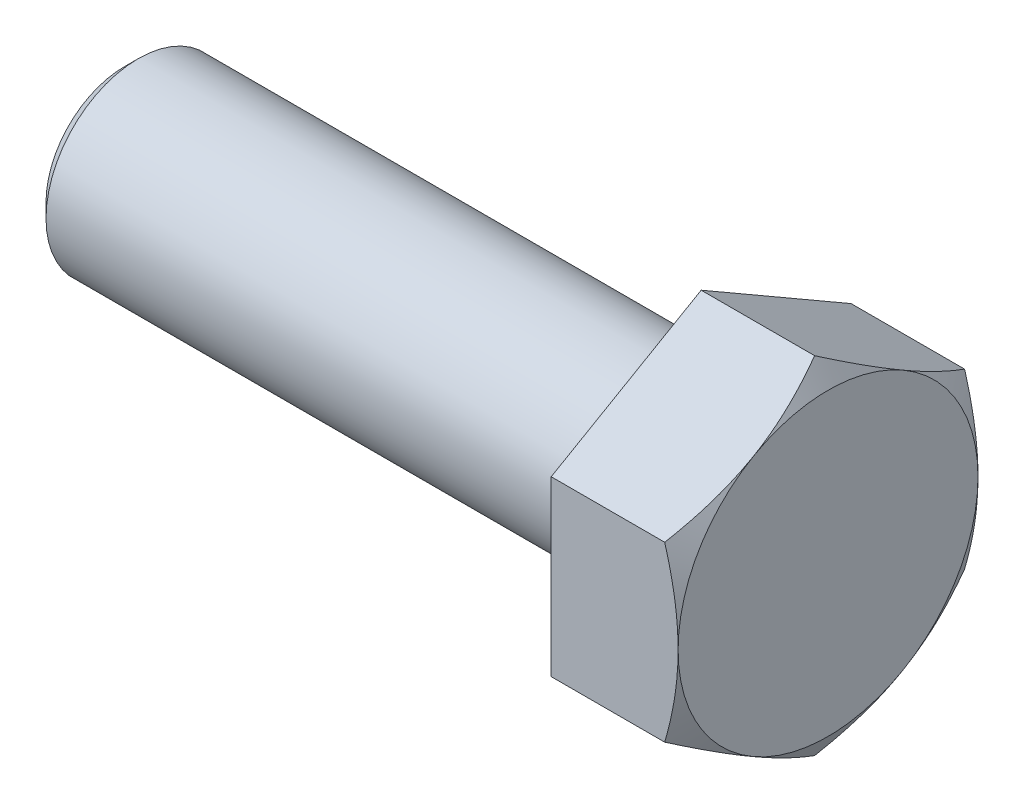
ISO-10303-21;
HEADER;
FILE_DESCRIPTION(('STEP AP214'),'2;1');
FILE_NAME('part.step','',(''),(''),'','','');
FILE_SCHEMA(('AUTOMOTIVE_DESIGN { 1 0 10303 214 1 1 1 1 }'));
ENDSEC;
DATA;
#1=APPLICATION_CONTEXT('core data for automotive mechanical design processes');
#2=APPLICATION_PROTOCOL_DEFINITION('international standard','automotive_design',2000,#1);
#3=PRODUCT_CONTEXT('',#1,'mechanical');
#4=PRODUCT('Part','Part','',(#3));
#5=PRODUCT_RELATED_PRODUCT_CATEGORY('part','',(#4));
#6=PRODUCT_DEFINITION_FORMATION('','',#4);
#7=PRODUCT_DEFINITION_CONTEXT('part definition',#1,'design');
#8=PRODUCT_DEFINITION('design','',#6,#7);
#9=PRODUCT_DEFINITION_SHAPE('','',#8);
#10=(LENGTH_UNIT() NAMED_UNIT(*) SI_UNIT(.MILLI.,.METRE.));
#11=(NAMED_UNIT(*) PLANE_ANGLE_UNIT() SI_UNIT($,.RADIAN.));
#12=(NAMED_UNIT(*) SI_UNIT($,.STERADIAN.) SOLID_ANGLE_UNIT());
#13=UNCERTAINTY_MEASURE_WITH_UNIT(LENGTH_MEASURE(1.E-05),#10,'distance_accuracy_value','');
#14=(GEOMETRIC_REPRESENTATION_CONTEXT(3) GLOBAL_UNCERTAINTY_ASSIGNED_CONTEXT((#13)) GLOBAL_UNIT_ASSIGNED_CONTEXT((#10,
#11,#12)) REPRESENTATION_CONTEXT('',''));
#15=CARTESIAN_POINT('',(0.,0.,0.));
#16=DIRECTION('',(0.,0.,1.));
#17=DIRECTION('',(1.,0.,0.));
#18=AXIS2_PLACEMENT_3D('',#15,#16,#17);
#19=CARTESIAN_POINT('',(5.5,3.75277674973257,6.5));
#20=DIRECTION('',(0.,0.866025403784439,0.5));
#21=DIRECTION('',(0.,-0.5,0.866025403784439));
#22=AXIS2_PLACEMENT_3D('',#19,#20,#21);
#23=PLANE('',#22);
#24=DIRECTION('',(-1.,0.,0.));
#25=VECTOR('',#24,1.);
#26=CARTESIAN_POINT('',(5.5,3.75277674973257,6.5));
#27=LINE('',#26,#25);
#28=CARTESIAN_POINT('',(4.91944341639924,3.75277674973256,6.5));
#29=VERTEX_POINT('',#28);
#30=CARTESIAN_POINT('',(0.,3.75277674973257,6.5));
#31=VERTEX_POINT('',#30);
#32=EDGE_CURVE('E140',#29,#31,#27,.T.);
#33=ORIENTED_EDGE('',*,*,#32,.F.);
#34=CARTESIAN_POINT('',(4.91937674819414,3.75266127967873,6.5002));
#35=CARTESIAN_POINT('',(4.96699557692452,3.8351516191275,6.35732254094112));
#36=CARTESIAN_POINT('',(5.0124532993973,3.91794952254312,6.21391236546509));
#37=CARTESIAN_POINT('',(5.09845131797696,4.08421773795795,5.9259273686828));
#38=CARTESIAN_POINT('',(5.13898949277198,4.16768832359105,5.78135207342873));
#39=CARTESIAN_POINT('',(5.25242899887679,4.41943655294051,5.34531134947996));
#40=CARTESIAN_POINT('',(5.31695219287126,4.58870793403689,5.05212471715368));
#41=CARTESIAN_POINT('',(5.39261341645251,4.84201947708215,4.61337625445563));
#42=CARTESIAN_POINT('',(5.41416714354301,4.92530276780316,4.46912536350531));
#43=CARTESIAN_POINT('',(5.45030968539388,5.09224566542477,4.17997178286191));
#44=CARTESIAN_POINT('',(5.46489911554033,5.17590523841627,4.03506915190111));
#45=CARTESIAN_POINT('',(5.48674124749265,5.34336968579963,3.74501222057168));
#46=CARTESIAN_POINT('',(5.49400227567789,5.427174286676,3.59985839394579));
#47=CARTESIAN_POINT('',(5.50103969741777,5.59485627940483,3.30942466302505));
#48=CARTESIAN_POINT('',(5.5008163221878,5.6787336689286,3.16414476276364));
#49=CARTESIAN_POINT('',(5.48991654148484,5.90853103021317,2.76612405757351));
#50=CARTESIAN_POINT('',(5.47161818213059,6.05437578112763,2.51351353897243));
#51=CARTESIAN_POINT('',(5.41359365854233,6.34509659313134,2.00997032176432));
#52=CARTESIAN_POINT('',(5.37384766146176,6.48997163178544,1.75903939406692));
#53=CARTESIAN_POINT('',(5.27449409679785,6.78127752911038,1.25448277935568));
#54=CARTESIAN_POINT('',(5.21446557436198,6.92767163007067,1.00092075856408));
#55=CARTESIAN_POINT('',(5.07822500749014,7.21827667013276,0.497578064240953));
#56=CARTESIAN_POINT('',(5.00204496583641,7.36249133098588,0.247790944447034));
#57=CARTESIAN_POINT('',(4.91937674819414,7.50566896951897,-0.000200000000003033));
#58=B_SPLINE_CURVE_WITH_KNOTS('',3,(#34,#35,#36,#37,#38,#39,#40,#41,#42,#43,#44,#45,#46,#47,#48,
#49,#50,#51,#52,#53,#54,#55,#56,#57),.UNSPECIFIED.,.F.,.F.,(4,2,2,2,2,2,2,2,2,2,2,4),(0.,
0.515105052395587,1.03043143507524,2.06322554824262,2.56697389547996,3.07067772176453,
3.57380860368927,4.07692394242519,4.9527935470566,5.82947446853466,6.72559912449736,
7.61996451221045),.UNSPECIFIED.);
#59=CARTESIAN_POINT('',(5.5,5.62916512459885,3.25));
#60=VERTEX_POINT('',#59);
#61=EDGE_CURVE('E120',#29,#60,#58,.T.);
#62=ORIENTED_EDGE('',*,*,#61,.T.);
#63=CARTESIAN_POINT('',(4.91944341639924,7.50555349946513,0.));
#64=VERTEX_POINT('',#63);
#65=EDGE_CURVE('E108',#60,#64,#58,.T.);
#66=ORIENTED_EDGE('',*,*,#65,.T.);
#67=DIRECTION('',(-1.,0.,0.));
#68=VECTOR('',#67,1.);
#69=CARTESIAN_POINT('',(5.5,7.50555349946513,0.));
#70=LINE('',#69,#68);
#71=CARTESIAN_POINT('',(0.,7.50555349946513,0.));
#72=VERTEX_POINT('',#71);
#73=EDGE_CURVE('E118',#64,#72,#70,.T.);
#74=ORIENTED_EDGE('',*,*,#73,.T.);
#75=DIRECTION('',(0.,0.5,-0.866025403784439));
#76=VECTOR('',#75,1.);
#77=CARTESIAN_POINT('',(0.,3.75277674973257,6.5));
#78=LINE('',#77,#76);
#79=EDGE_CURVE('E238',#31,#72,#78,.T.);
#80=ORIENTED_EDGE('',*,*,#79,.F.);
#81=EDGE_LOOP('',(#33,#62,#66,#74,#80));
#82=FACE_BOUND('',#81,.T.);
#83=ADVANCED_FACE('F34',(#82),#23,.T.);
#84=CARTESIAN_POINT('',(5.5,-3.75277674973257,6.5));
#85=DIRECTION('',(0.,0.,1.));
#86=DIRECTION('',(1.,0.,0.));
#87=AXIS2_PLACEMENT_3D('',#84,#85,#86);
#88=PLANE('',#87);
#89=DIRECTION('',(-1.,0.,0.));
#90=VECTOR('',#89,1.);
#91=CARTESIAN_POINT('',(5.5,-3.75277674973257,6.5));
#92=LINE('',#91,#90);
#93=CARTESIAN_POINT('',(4.91944341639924,-3.75277674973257,6.5));
#94=VERTEX_POINT('',#93);
#95=CARTESIAN_POINT('',(0.,-3.75277674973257,6.5));
#96=VERTEX_POINT('',#95);
#97=EDGE_CURVE('E168',#94,#96,#92,.T.);
#98=ORIENTED_EDGE('',*,*,#97,.F.);
#99=CARTESIAN_POINT('',(2.38957641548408,-9.95291698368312,6.5));
#100=CARTESIAN_POINT('',(2.52749106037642,-9.66753022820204,6.5));
#101=CARTESIAN_POINT('',(2.66403471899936,-9.38146872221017,6.5));
#102=CARTESIAN_POINT('',(2.9335966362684,-8.80763137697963,6.5));
#103=CARTESIAN_POINT('',(3.0666142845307,-8.51985525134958,6.5));
#104=CARTESIAN_POINT('',(3.3290414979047,-7.94066929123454,6.5));
#105=CARTESIAN_POINT('',(3.45842605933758,-7.64924808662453,6.5));
#106=CARTESIAN_POINT('',(3.71163779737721,-7.06401043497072,6.5));
#107=CARTESIAN_POINT('',(3.8354652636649,-6.77019411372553,6.5));
#108=CARTESIAN_POINT('',(4.07755519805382,-6.17605150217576,6.5));
#109=CARTESIAN_POINT('',(4.19573068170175,-5.87568957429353,6.5));
#110=CARTESIAN_POINT('',(4.42282610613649,-5.27142269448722,6.5));
#111=CARTESIAN_POINT('',(4.53174501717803,-4.96751735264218,6.5));
#112=CARTESIAN_POINT('',(4.73740097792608,-4.3563054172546,6.5));
#113=CARTESIAN_POINT('',(4.83416392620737,-4.04900762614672,6.5));
#114=CARTESIAN_POINT('',(5.01236428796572,-3.43004022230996,6.5));
#115=CARTESIAN_POINT('',(5.09380654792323,-3.11837202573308,6.5));
#116=CARTESIAN_POINT('',(5.23741591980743,-2.49046594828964,6.5));
#117=CARTESIAN_POINT('',(5.29957789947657,-2.17422687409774,6.5));
#118=CARTESIAN_POINT('',(5.40042577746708,-1.5378916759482,6.5));
#119=CARTESIAN_POINT('',(5.43911165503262,-1.21779554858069,6.5));
#120=CARTESIAN_POINT('',(5.47705343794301,-0.737141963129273,6.5));
#121=CARTESIAN_POINT('',(5.48635478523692,-0.577336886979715,6.5));
#122=CARTESIAN_POINT('',(5.49818591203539,-0.257468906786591,6.5));
#123=CARTESIAN_POINT('',(5.50071577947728,-0.0974060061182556,6.5));
#124=CARTESIAN_POINT('',(5.49893598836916,0.222635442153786,6.5));
#125=CARTESIAN_POINT('',(5.49462824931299,0.382614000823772,6.5));
#126=CARTESIAN_POINT('',(5.47928241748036,0.702250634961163,6.5));
#127=CARTESIAN_POINT('',(5.46824398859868,0.861908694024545,6.5));
#128=CARTESIAN_POINT('',(5.43356313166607,1.24887053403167,6.5));
#129=CARTESIAN_POINT('',(5.40654812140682,1.47587694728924,6.5));
#130=CARTESIAN_POINT('',(5.34041011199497,1.928150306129,6.5));
#131=CARTESIAN_POINT('',(5.3012838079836,2.15341675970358,6.5));
#132=CARTESIAN_POINT('',(5.2123108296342,2.60202427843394,6.5));
#133=CARTESIAN_POINT('',(5.16245401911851,2.8253633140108,6.5));
#134=CARTESIAN_POINT('',(5.05354123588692,3.2697435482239,6.5));
#135=CARTESIAN_POINT('',(4.99448612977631,3.490784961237,6.5));
#136=CARTESIAN_POINT('',(4.86704588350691,3.93601414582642,6.5));
#137=CARTESIAN_POINT('',(4.79846752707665,4.16014622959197,6.5));
#138=CARTESIAN_POINT('',(4.65453487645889,4.60604131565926,6.5));
#139=CARTESIAN_POINT('',(4.57918525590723,4.82780583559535,6.5));
#140=CARTESIAN_POINT('',(4.42326649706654,5.26807593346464,6.5));
#141=CARTESIAN_POINT('',(4.34272912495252,5.48659282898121,6.5));
#142=CARTESIAN_POINT('',(4.17692729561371,5.92193123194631,6.5));
#143=CARTESIAN_POINT('',(4.09166092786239,6.13875201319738,6.5));
#144=CARTESIAN_POINT('',(4.00449786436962,6.35478510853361,6.5));
#145=B_SPLINE_CURVE_WITH_KNOTS('',3,(#99,#100,#101,#102,#103,#104,#105,#106,#107,#108,#109,#110,
#111,#112,#113,#114,#115,#116,#117,#118,#119,#120,#121,#122,#123,#124,#125,#126,#127,#128,#129,
#130,#131,#132,#133,#134,#135,#136,#137,#138,#139,#140,#141,#142,#143,#144),.UNSPECIFIED.,.F.,
.F.,(4,2,2,2,2,2,2,2,2,2,2,2,2,2,2,2,2,2,2,2,2,2,4),(0.,0.950904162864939,1.90197187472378,
2.85848216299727,3.81494253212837,4.78314526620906,5.75145556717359,6.71766655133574,
7.68357137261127,8.64973308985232,9.61589566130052,10.0960003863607,10.5760988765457,
11.0560626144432,11.5360503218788,12.2214931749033,12.9071232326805,13.5934038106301,
14.2796197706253,14.9826563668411,15.6852113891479,16.3838119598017,17.0826968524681),.UNSPECIFIED.);
#146=CARTESIAN_POINT('',(5.5,0.,6.5));
#147=VERTEX_POINT('',#146);
#148=EDGE_CURVE('E164',#94,#147,#145,.T.);
#149=ORIENTED_EDGE('',*,*,#148,.T.);
#150=EDGE_CURVE('E166',#147,#29,#145,.T.);
#151=ORIENTED_EDGE('',*,*,#150,.T.);
#152=ORIENTED_EDGE('',*,*,#32,.T.);
#153=DIRECTION('',(0.,1.,0.));
#154=VECTOR('',#153,1.);
#155=CARTESIAN_POINT('',(0.,-3.75277674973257,6.5));
#156=LINE('',#155,#154);
#157=EDGE_CURVE('E127',#96,#31,#156,.T.);
#158=ORIENTED_EDGE('',*,*,#157,.F.);
#159=EDGE_LOOP('',(#98,#149,#151,#152,#158));
#160=FACE_BOUND('',#159,.T.);
#161=ADVANCED_FACE('F165',(#160),#88,.T.);
#162=CARTESIAN_POINT('',(5.5,-7.50555349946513,0.));
#163=DIRECTION('',(0.,-0.866025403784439,0.5));
#164=DIRECTION('',(0.,-0.5,-0.866025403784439));
#165=AXIS2_PLACEMENT_3D('',#162,#163,#164);
#166=PLANE('',#165);
#167=DIRECTION('',(-1.,0.,0.));
#168=VECTOR('',#167,1.);
#169=CARTESIAN_POINT('',(5.5,-7.50555349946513,0.));
#170=LINE('',#169,#168);
#171=CARTESIAN_POINT('',(4.91944341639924,-7.50555349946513,0.));
#172=VERTEX_POINT('',#171);
#173=CARTESIAN_POINT('',(0.,-7.50555349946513,0.));
#174=VERTEX_POINT('',#173);
#175=EDGE_CURVE('E252',#172,#174,#170,.T.);
#176=ORIENTED_EDGE('',*,*,#175,.F.);
#177=CARTESIAN_POINT('',(4.91937674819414,-7.50566896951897,-0.000199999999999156));
#178=CARTESIAN_POINT('',(4.96699557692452,-7.4231786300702,0.142677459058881));
#179=CARTESIAN_POINT('',(5.0124532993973,-7.34038072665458,0.286087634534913));
#180=CARTESIAN_POINT('',(5.09845131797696,-7.17411251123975,0.574072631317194));
#181=CARTESIAN_POINT('',(5.13898949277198,-7.09064192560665,0.718647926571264));
#182=CARTESIAN_POINT('',(5.25242899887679,-6.83889369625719,1.15468865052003));
#183=CARTESIAN_POINT('',(5.31695219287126,-6.66962231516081,1.44787528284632));
#184=CARTESIAN_POINT('',(5.39261341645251,-6.41631077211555,1.88662374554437));
#185=CARTESIAN_POINT('',(5.41416714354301,-6.33302748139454,2.03087463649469));
#186=CARTESIAN_POINT('',(5.45030968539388,-6.16608458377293,2.32002821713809));
#187=CARTESIAN_POINT('',(5.46489911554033,-6.08242501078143,2.46493084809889));
#188=CARTESIAN_POINT('',(5.48674124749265,-5.91496056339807,2.75498777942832));
#189=CARTESIAN_POINT('',(5.49400227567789,-5.8311559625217,2.90014160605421));
#190=CARTESIAN_POINT('',(5.50103969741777,-5.66347396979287,3.19057533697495));
#191=CARTESIAN_POINT('',(5.5008163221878,-5.5795965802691,3.33585523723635));
#192=CARTESIAN_POINT('',(5.48991654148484,-5.34979921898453,3.73387594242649));
#193=CARTESIAN_POINT('',(5.47161818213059,-5.20395446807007,3.98648646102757));
#194=CARTESIAN_POINT('',(5.41359365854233,-4.91323365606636,4.49002967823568));
#195=CARTESIAN_POINT('',(5.37384766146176,-4.76835861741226,4.74096060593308));
#196=CARTESIAN_POINT('',(5.27449409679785,-4.47705272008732,5.24551722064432));
#197=CARTESIAN_POINT('',(5.21446557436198,-4.33065861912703,5.49907924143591));
#198=CARTESIAN_POINT('',(5.07822500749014,-4.04005357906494,6.00242193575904));
#199=CARTESIAN_POINT('',(5.00204496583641,-3.89583891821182,6.25220905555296));
#200=CARTESIAN_POINT('',(4.91937674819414,-3.75266127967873,6.5002));
#201=B_SPLINE_CURVE_WITH_KNOTS('',3,(#177,#178,#179,#180,#181,#182,#183,#184,#185,#186,#187,
#188,#189,#190,#191,#192,#193,#194,#195,#196,#197,#198,#199,#200),.UNSPECIFIED.,.F.,.F.,(4,2,2,
2,2,2,2,2,2,2,2,4),(0.,0.515105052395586,1.03043143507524,2.06322554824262,2.56697389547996,
3.07067772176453,3.57380860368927,4.07692394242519,4.9527935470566,5.82947446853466,
6.72559912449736,7.61996451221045),.UNSPECIFIED.);
#202=CARTESIAN_POINT('',(5.5,-5.62916512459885,3.25));
#203=VERTEX_POINT('',#202);
#204=EDGE_CURVE('E241',#172,#203,#201,.T.);
#205=ORIENTED_EDGE('',*,*,#204,.T.);
#206=EDGE_CURVE('E174',#203,#94,#201,.T.);
#207=ORIENTED_EDGE('',*,*,#206,.T.);
#208=ORIENTED_EDGE('',*,*,#97,.T.);
#209=DIRECTION('',(0.,0.5,0.866025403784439));
#210=VECTOR('',#209,1.);
#211=CARTESIAN_POINT('',(0.,-7.50555349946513,0.));
#212=LINE('',#211,#210);
#213=EDGE_CURVE('E132',#174,#96,#212,.T.);
#214=ORIENTED_EDGE('',*,*,#213,.F.);
#215=EDGE_LOOP('',(#176,#205,#207,#208,#214));
#216=FACE_BOUND('',#215,.T.);
#217=ADVANCED_FACE('F266',(#216),#166,.T.);
#218=CARTESIAN_POINT('',(5.5,-3.75277674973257,-6.5));
#219=DIRECTION('',(0.,-0.866025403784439,-0.5));
#220=DIRECTION('',(0.,0.5,-0.866025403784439));
#221=AXIS2_PLACEMENT_3D('',#218,#219,#220);
#222=PLANE('',#221);
#223=DIRECTION('',(-1.,0.,0.));
#224=VECTOR('',#223,1.);
#225=CARTESIAN_POINT('',(5.5,-3.75277674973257,-6.5));
#226=LINE('',#225,#224);
#227=CARTESIAN_POINT('',(4.91944341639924,-3.75277674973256,-6.5));
#228=VERTEX_POINT('',#227);
#229=CARTESIAN_POINT('',(0.,-3.75277674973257,-6.5));
#230=VERTEX_POINT('',#229);
#231=EDGE_CURVE('E129',#228,#230,#226,.T.);
#232=ORIENTED_EDGE('',*,*,#231,.F.);
#233=CARTESIAN_POINT('',(4.91937674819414,-3.75266127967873,-6.5002));
#234=CARTESIAN_POINT('',(4.96699557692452,-3.8351516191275,-6.35732254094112));
#235=CARTESIAN_POINT('',(5.0124532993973,-3.91794952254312,-6.21391236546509));
#236=CARTESIAN_POINT('',(5.09845131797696,-4.08421773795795,-5.9259273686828));
#237=CARTESIAN_POINT('',(5.13898949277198,-4.16768832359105,-5.78135207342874));
#238=CARTESIAN_POINT('',(5.25242899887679,-4.41943655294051,-5.34531134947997));
#239=CARTESIAN_POINT('',(5.31695219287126,-4.58870793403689,-5.05212471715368));
#240=CARTESIAN_POINT('',(5.39261341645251,-4.84201947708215,-4.61337625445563));
#241=CARTESIAN_POINT('',(5.41416714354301,-4.92530276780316,-4.46912536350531));
#242=CARTESIAN_POINT('',(5.45030968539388,-5.09224566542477,-4.17997178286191));
#243=CARTESIAN_POINT('',(5.46489911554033,-5.17590523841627,-4.03506915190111));
#244=CARTESIAN_POINT('',(5.48674124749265,-5.34336968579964,-3.74501222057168));
#245=CARTESIAN_POINT('',(5.49400227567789,-5.427174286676,-3.59985839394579));
#246=CARTESIAN_POINT('',(5.50103969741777,-5.59485627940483,-3.30942466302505));
#247=CARTESIAN_POINT('',(5.5008163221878,-5.6787336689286,-3.16414476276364));
#248=CARTESIAN_POINT('',(5.48991654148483,-5.90853103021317,-2.76612405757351));
#249=CARTESIAN_POINT('',(5.47161818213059,-6.05437578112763,-2.51351353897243));
#250=CARTESIAN_POINT('',(5.41359365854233,-6.34509659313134,-2.00997032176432));
#251=CARTESIAN_POINT('',(5.37384766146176,-6.48997163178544,-1.75903939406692));
#252=CARTESIAN_POINT('',(5.27449409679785,-6.78127752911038,-1.25448277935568));
#253=CARTESIAN_POINT('',(5.21446557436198,-6.92767163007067,-1.00092075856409));
#254=CARTESIAN_POINT('',(5.07822500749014,-7.21827667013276,-0.497578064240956));
#255=CARTESIAN_POINT('',(5.00204496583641,-7.36249133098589,-0.247790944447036));
#256=CARTESIAN_POINT('',(4.91937674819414,-7.50566896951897,0.000200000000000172));
#257=B_SPLINE_CURVE_WITH_KNOTS('',3,(#233,#234,#235,#236,#237,#238,#239,#240,#241,#242,#243,
#244,#245,#246,#247,#248,#249,#250,#251,#252,#253,#254,#255,#256),.UNSPECIFIED.,.F.,.F.,(4,2,2,
2,2,2,2,2,2,2,2,4),(0.,0.515105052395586,1.03043143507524,2.06322554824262,2.56697389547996,
3.07067772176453,3.57380860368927,4.07692394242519,4.9527935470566,5.82947446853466,
6.72559912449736,7.61996451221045),.UNSPECIFIED.);
#258=CARTESIAN_POINT('',(5.5,-5.62916512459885,-3.25));
#259=VERTEX_POINT('',#258);
#260=EDGE_CURVE('E176',#228,#259,#257,.T.);
#261=ORIENTED_EDGE('',*,*,#260,.T.);
#262=EDGE_CURVE('E171',#259,#172,#257,.T.);
#263=ORIENTED_EDGE('',*,*,#262,.T.);
#264=ORIENTED_EDGE('',*,*,#175,.T.);
#265=DIRECTION('',(0.,-0.5,0.866025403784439));
#266=VECTOR('',#265,1.);
#267=CARTESIAN_POINT('',(0.,-3.75277674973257,-6.5));
#268=LINE('',#267,#266);
#269=EDGE_CURVE('E246',#230,#174,#268,.T.);
#270=ORIENTED_EDGE('',*,*,#269,.F.);
#271=EDGE_LOOP('',(#232,#261,#263,#264,#270));
#272=FACE_BOUND('',#271,.T.);
#273=ADVANCED_FACE('F262',(#272),#222,.T.);
#274=CARTESIAN_POINT('',(5.5,3.75277674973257,-6.5));
#275=DIRECTION('',(0.,0.,-1.));
#276=DIRECTION('',(0.,1.,0.));
#277=AXIS2_PLACEMENT_3D('',#274,#275,#276);
#278=PLANE('',#277);
#279=DIRECTION('',(-1.,0.,0.));
#280=VECTOR('',#279,1.);
#281=CARTESIAN_POINT('',(5.5,3.75277674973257,-6.5));
#282=LINE('',#281,#280);
#283=CARTESIAN_POINT('',(4.91944341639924,3.75277674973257,-6.5));
#284=VERTEX_POINT('',#283);
#285=CARTESIAN_POINT('',(0.,3.75277674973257,-6.5));
#286=VERTEX_POINT('',#285);
#287=EDGE_CURVE('E126',#284,#286,#282,.T.);
#288=ORIENTED_EDGE('',*,*,#287,.F.);
#289=CARTESIAN_POINT('',(2.38957641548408,-9.95291698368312,-6.5));
#290=CARTESIAN_POINT('',(2.52749106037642,-9.66753022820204,-6.5));
#291=CARTESIAN_POINT('',(2.66403471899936,-9.38146872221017,-6.5));
#292=CARTESIAN_POINT('',(2.9335966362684,-8.80763137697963,-6.5));
#293=CARTESIAN_POINT('',(3.0666142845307,-8.51985525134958,-6.5));
#294=CARTESIAN_POINT('',(3.3290414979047,-7.94066929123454,-6.5));
#295=CARTESIAN_POINT('',(3.45842605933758,-7.64924808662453,-6.5));
#296=CARTESIAN_POINT('',(3.7116377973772,-7.06401043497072,-6.5));
#297=CARTESIAN_POINT('',(3.8354652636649,-6.77019411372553,-6.5));
#298=CARTESIAN_POINT('',(4.07755519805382,-6.17605150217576,-6.5));
#299=CARTESIAN_POINT('',(4.19573068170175,-5.87568957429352,-6.5));
#300=CARTESIAN_POINT('',(4.42282610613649,-5.27142269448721,-6.5));
#301=CARTESIAN_POINT('',(4.53174501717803,-4.96751735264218,-6.5));
#302=CARTESIAN_POINT('',(4.73740097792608,-4.3563054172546,-6.5));
#303=CARTESIAN_POINT('',(4.83416392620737,-4.04900762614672,-6.5));
#304=CARTESIAN_POINT('',(5.01236428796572,-3.43004022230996,-6.5));
#305=CARTESIAN_POINT('',(5.09380654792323,-3.11837202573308,-6.5));
#306=CARTESIAN_POINT('',(5.23741591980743,-2.49046594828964,-6.5));
#307=CARTESIAN_POINT('',(5.29957789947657,-2.17422687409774,-6.5));
#308=CARTESIAN_POINT('',(5.40042577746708,-1.5378916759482,-6.5));
#309=CARTESIAN_POINT('',(5.43911165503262,-1.21779554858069,-6.5));
#310=CARTESIAN_POINT('',(5.477053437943,-0.737141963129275,-6.5));
#311=CARTESIAN_POINT('',(5.48635478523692,-0.577336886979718,-6.5));
#312=CARTESIAN_POINT('',(5.49818591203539,-0.257468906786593,-6.5));
#313=CARTESIAN_POINT('',(5.50071577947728,-0.0974060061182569,-6.5));
#314=CARTESIAN_POINT('',(5.49893598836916,0.222635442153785,-6.5));
#315=CARTESIAN_POINT('',(5.49462824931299,0.382614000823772,-6.5));
#316=CARTESIAN_POINT('',(5.47928241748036,0.702250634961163,-6.5));
#317=CARTESIAN_POINT('',(5.46824398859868,0.861908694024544,-6.5));
#318=CARTESIAN_POINT('',(5.43356313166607,1.24887053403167,-6.5));
#319=CARTESIAN_POINT('',(5.40654812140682,1.47587694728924,-6.5));
#320=CARTESIAN_POINT('',(5.34041011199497,1.928150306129,-6.5));
#321=CARTESIAN_POINT('',(5.30128380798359,2.15341675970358,-6.5));
#322=CARTESIAN_POINT('',(5.2123108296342,2.60202427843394,-6.5));
#323=CARTESIAN_POINT('',(5.16245401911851,2.8253633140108,-6.5));
#324=CARTESIAN_POINT('',(5.05354123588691,3.2697435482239,-6.5));
#325=CARTESIAN_POINT('',(4.9944861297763,3.490784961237,-6.5));
#326=CARTESIAN_POINT('',(4.86704588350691,3.93601414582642,-6.5));
#327=CARTESIAN_POINT('',(4.79846752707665,4.16014622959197,-6.5));
#328=CARTESIAN_POINT('',(4.65453487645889,4.60604131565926,-6.5));
#329=CARTESIAN_POINT('',(4.57918525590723,4.82780583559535,-6.5));
#330=CARTESIAN_POINT('',(4.42326649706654,5.26807593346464,-6.5));
#331=CARTESIAN_POINT('',(4.34272912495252,5.4865928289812,-6.5));
#332=CARTESIAN_POINT('',(4.17692729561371,5.92193123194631,-6.5));
#333=CARTESIAN_POINT('',(4.09166092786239,6.13875201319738,-6.5));
#334=CARTESIAN_POINT('',(4.00449786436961,6.35478510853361,-6.5));
#335=B_SPLINE_CURVE_WITH_KNOTS('',3,(#289,#290,#291,#292,#293,#294,#295,#296,#297,#298,#299,
#300,#301,#302,#303,#304,#305,#306,#307,#308,#309,#310,#311,#312,#313,#314,#315,#316,#317,#318,
#319,#320,#321,#322,#323,#324,#325,#326,#327,#328,#329,#330,#331,#332,#333,#334),.UNSPECIFIED.,
.F.,.F.,(4,2,2,2,2,2,2,2,2,2,2,2,2,2,2,2,2,2,2,2,2,2,4),(0.,0.950904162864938,1.90197187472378,
2.85848216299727,3.81494253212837,4.78314526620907,5.7514555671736,6.71766655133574,
7.68357137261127,8.64973308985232,9.61589566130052,10.0960003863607,10.5760988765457,
11.0560626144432,11.5360503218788,12.2214931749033,12.9071232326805,13.5934038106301,
14.2796197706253,14.9826563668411,15.6852113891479,16.3838119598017,17.0826968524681),.UNSPECIFIED.);
#336=CARTESIAN_POINT('',(5.5,0.,-6.5));
#337=VERTEX_POINT('',#336);
#338=EDGE_CURVE('E54',#284,#337,#335,.F.);
#339=ORIENTED_EDGE('',*,*,#338,.T.);
#340=EDGE_CURVE('E260',#337,#228,#335,.F.);
#341=ORIENTED_EDGE('',*,*,#340,.T.);
#342=ORIENTED_EDGE('',*,*,#231,.T.);
#343=DIRECTION('',(0.,-1.,0.));
#344=VECTOR('',#343,1.);
#345=CARTESIAN_POINT('',(0.,3.75277674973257,-6.5));
#346=LINE('',#345,#344);
#347=EDGE_CURVE('E242',#286,#230,#346,.T.);
#348=ORIENTED_EDGE('',*,*,#347,.F.);
#349=EDGE_LOOP('',(#288,#339,#341,#342,#348));
#350=FACE_BOUND('',#349,.T.);
#351=ADVANCED_FACE('F259',(#350),#278,.T.);
#352=CARTESIAN_POINT('',(5.5,7.50555349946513,0.));
#353=DIRECTION('',(0.,0.866025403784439,-0.5));
#354=DIRECTION('',(0.,0.5,0.866025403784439));
#355=AXIS2_PLACEMENT_3D('',#352,#353,#354);
#356=PLANE('',#355);
#357=ORIENTED_EDGE('',*,*,#73,.F.);
#358=CARTESIAN_POINT('',(4.91937674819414,7.50566896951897,0.00019999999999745));
#359=CARTESIAN_POINT('',(4.96699557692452,7.42317863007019,-0.142677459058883));
#360=CARTESIAN_POINT('',(5.0124532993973,7.34038072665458,-0.286087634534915));
#361=CARTESIAN_POINT('',(5.09845131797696,7.17411251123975,-0.574072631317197));
#362=CARTESIAN_POINT('',(5.13898949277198,7.09064192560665,-0.718647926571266));
#363=CARTESIAN_POINT('',(5.2524289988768,6.83889369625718,-1.15468865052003));
#364=CARTESIAN_POINT('',(5.31695219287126,6.6696223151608,-1.44787528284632));
#365=CARTESIAN_POINT('',(5.39261341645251,6.41631077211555,-1.88662374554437));
#366=CARTESIAN_POINT('',(5.41416714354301,6.33302748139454,-2.03087463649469));
#367=CARTESIAN_POINT('',(5.45030968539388,6.16608458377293,-2.32002821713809));
#368=CARTESIAN_POINT('',(5.46489911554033,6.08242501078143,-2.46493084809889));
#369=CARTESIAN_POINT('',(5.48674124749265,5.91496056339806,-2.75498777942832));
#370=CARTESIAN_POINT('',(5.49400227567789,5.8311559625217,-2.90014160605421));
#371=CARTESIAN_POINT('',(5.50103969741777,5.66347396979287,-3.19057533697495));
#372=CARTESIAN_POINT('',(5.5008163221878,5.5795965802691,-3.33585523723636));
#373=CARTESIAN_POINT('',(5.48991654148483,5.34979921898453,-3.73387594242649));
#374=CARTESIAN_POINT('',(5.47161818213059,5.20395446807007,-3.98648646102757));
#375=CARTESIAN_POINT('',(5.41359365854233,4.91323365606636,-4.49002967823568));
#376=CARTESIAN_POINT('',(5.37384766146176,4.76835861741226,-4.74096060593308));
#377=CARTESIAN_POINT('',(5.27449409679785,4.47705272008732,-5.24551722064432));
#378=CARTESIAN_POINT('',(5.21446557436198,4.33065861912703,-5.49907924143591));
#379=CARTESIAN_POINT('',(5.07822500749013,4.04005357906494,-6.00242193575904));
#380=CARTESIAN_POINT('',(5.00204496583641,3.89583891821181,-6.25220905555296));
#381=CARTESIAN_POINT('',(4.91937674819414,3.75266127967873,-6.5002));
#382=B_SPLINE_CURVE_WITH_KNOTS('',3,(#358,#359,#360,#361,#362,#363,#364,#365,#366,#367,#368,
#369,#370,#371,#372,#373,#374,#375,#376,#377,#378,#379,#380,#381),.UNSPECIFIED.,.F.,.F.,(4,2,2,
2,2,2,2,2,2,2,2,4),(0.,0.515105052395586,1.03043143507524,2.06322554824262,2.56697389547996,
3.07067772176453,3.57380860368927,4.07692394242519,4.9527935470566,5.82947446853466,
6.72559912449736,7.61996451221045),.UNSPECIFIED.);
#383=CARTESIAN_POINT('',(5.5,5.62916512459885,-3.25));
#384=VERTEX_POINT('',#383);
#385=EDGE_CURVE('E105',#64,#384,#382,.T.);
#386=ORIENTED_EDGE('',*,*,#385,.T.);
#387=EDGE_CURVE('E112',#384,#284,#382,.T.);
#388=ORIENTED_EDGE('',*,*,#387,.T.);
#389=ORIENTED_EDGE('',*,*,#287,.T.);
#390=DIRECTION('',(0.,-0.5,-0.866025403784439));
#391=VECTOR('',#390,1.);
#392=CARTESIAN_POINT('',(0.,7.50555349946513,0.));
#393=LINE('',#392,#391);
#394=EDGE_CURVE('E124',#72,#286,#393,.T.);
#395=ORIENTED_EDGE('',*,*,#394,.F.);
#396=EDGE_LOOP('',(#357,#386,#388,#389,#395));
#397=FACE_BOUND('',#396,.T.);
#398=ADVANCED_FACE('F122',(#397),#356,.T.);
#399=CARTESIAN_POINT('',(-25.,0.,0.));
#400=DIRECTION('',(-1.,0.,0.));
#401=DIRECTION('',(0.,0.,1.));
#402=AXIS2_PLACEMENT_3D('',#399,#400,#401);
#403=PLANE('',#402);
#404=CARTESIAN_POINT('',(-25.,0.,0.));
#405=DIRECTION('',(-1.,0.,0.));
#406=DIRECTION('',(0.,0.,1.));
#407=AXIS2_PLACEMENT_3D('',#404,#405,#406);
#408=CIRCLE('',#407,3.4);
#409=CARTESIAN_POINT('',(-25.,0.,3.4));
#410=VERTEX_POINT('',#409);
#411=EDGE_CURVE('E139',#410,#410,#408,.T.);
#412=ORIENTED_EDGE('',*,*,#411,.T.);
#413=EDGE_LOOP('',(#412));
#414=FACE_BOUND('',#413,.T.);
#415=ADVANCED_FACE('F36',(#414),#403,.T.);
#416=CARTESIAN_POINT('',(-110.,0.,0.));
#417=DIRECTION('',(-1.,0.,0.));
#418=DIRECTION('',(0.,0.,1.));
#419=AXIS2_PLACEMENT_3D('',#416,#417,#418);
#420=CYLINDRICAL_SURFACE('',#419,4.);
#421=CARTESIAN_POINT('',(-24.4,0.,0.));
#422=DIRECTION('',(-1.,0.,0.));
#423=DIRECTION('',(0.,0.,1.));
#424=AXIS2_PLACEMENT_3D('',#421,#422,#423);
#425=CIRCLE('',#424,4.);
#426=CARTESIAN_POINT('',(-24.4,0.,4.));
#427=VERTEX_POINT('',#426);
#428=EDGE_CURVE('E142',#427,#427,#425,.F.);
#429=ORIENTED_EDGE('',*,*,#428,.T.);
#430=EDGE_LOOP('',(#429));
#431=FACE_BOUND('',#430,.T.);
#432=CARTESIAN_POINT('',(0.,0.,0.));
#433=DIRECTION('',(1.,0.,0.));
#434=DIRECTION('',(0.,0.,-1.));
#435=AXIS2_PLACEMENT_3D('',#432,#433,#434);
#436=CIRCLE('',#435,4.);
#437=CARTESIAN_POINT('',(0.,0.,-4.));
#438=VERTEX_POINT('',#437);
#439=EDGE_CURVE('E136',#438,#438,#436,.F.);
#440=ORIENTED_EDGE('',*,*,#439,.T.);
#441=EDGE_LOOP('',(#440));
#442=FACE_BOUND('',#441,.T.);
#443=ADVANCED_FACE('F225',(#431,#442),#420,.T.);
#444=CARTESIAN_POINT('',(-25.,0.,0.));
#445=DIRECTION('',(1.,0.,0.));
#446=DIRECTION('',(0.,0.,-1.));
#447=AXIS2_PLACEMENT_3D('',#444,#445,#446);
#448=CONICAL_SURFACE('',#447,3.39999999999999,0.785398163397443);
#449=ORIENTED_EDGE('',*,*,#428,.F.);
#450=EDGE_LOOP('',(#449));
#451=FACE_BOUND('',#450,.T.);
#452=ORIENTED_EDGE('',*,*,#411,.F.);
#453=EDGE_LOOP('',(#452));
#454=FACE_BOUND('',#453,.T.);
#455=ADVANCED_FACE('F223',(#451,#454),#448,.T.);
#456=CARTESIAN_POINT('',(0.,3.75277674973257,6.5));
#457=DIRECTION('',(1.,0.,0.));
#458=DIRECTION('',(0.,0.,-1.));
#459=AXIS2_PLACEMENT_3D('',#456,#457,#458);
#460=PLANE('',#459);
#461=ORIENTED_EDGE('',*,*,#439,.F.);
#462=EDGE_LOOP('',(#461));
#463=FACE_BOUND('',#462,.T.);
#464=ORIENTED_EDGE('',*,*,#79,.T.);
#465=ORIENTED_EDGE('',*,*,#394,.T.);
#466=ORIENTED_EDGE('',*,*,#347,.T.);
#467=ORIENTED_EDGE('',*,*,#269,.T.);
#468=ORIENTED_EDGE('',*,*,#213,.T.);
#469=ORIENTED_EDGE('',*,*,#157,.T.);
#470=EDGE_LOOP('',(#464,#465,#466,#467,#468,#469));
#471=FACE_BOUND('',#470,.T.);
#472=ADVANCED_FACE('F199',(#463,#471),#460,.F.);
#473=CARTESIAN_POINT('',(5.5,0.,0.));
#474=DIRECTION('',(-1.,0.,0.));
#475=DIRECTION('',(0.,0.,1.));
#476=AXIS2_PLACEMENT_3D('',#473,#474,#475);
#477=CONICAL_SURFACE('',#476,6.5,1.0471975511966);
#478=ORIENTED_EDGE('',*,*,#340,.F.);
#479=CARTESIAN_POINT('',(5.5,0.,0.));
#480=DIRECTION('',(1.,0.,0.));
#481=DIRECTION('',(0.,0.,-1.));
#482=AXIS2_PLACEMENT_3D('',#479,#480,#481);
#483=CIRCLE('',#482,6.5);
#484=EDGE_CURVE('E38',#259,#337,#483,.T.);
#485=ORIENTED_EDGE('',*,*,#484,.F.);
#486=ORIENTED_EDGE('',*,*,#260,.F.);
#487=EDGE_LOOP('',(#478,#485,#486));
#488=FACE_BOUND('',#487,.T.);
#489=ADVANCED_FACE('F237',(#488),#477,.T.);
#490=ORIENTED_EDGE('',*,*,#262,.F.);
#491=EDGE_CURVE('E147',#203,#259,#483,.T.);
#492=ORIENTED_EDGE('',*,*,#491,.F.);
#493=ORIENTED_EDGE('',*,*,#204,.F.);
#494=EDGE_LOOP('',(#490,#492,#493));
#495=FACE_BOUND('',#494,.T.);
#496=ADVANCED_FACE('F198',(#495),#477,.T.);
#497=EDGE_CURVE('E151',#147,#203,#483,.T.);
#498=ORIENTED_EDGE('',*,*,#497,.F.);
#499=ORIENTED_EDGE('',*,*,#148,.F.);
#500=ORIENTED_EDGE('',*,*,#206,.F.);
#501=EDGE_LOOP('',(#498,#499,#500));
#502=FACE_BOUND('',#501,.T.);
#503=ADVANCED_FACE('F267',(#502),#477,.T.);
#504=EDGE_CURVE('E43',#60,#147,#483,.T.);
#505=ORIENTED_EDGE('',*,*,#504,.F.);
#506=ORIENTED_EDGE('',*,*,#61,.F.);
#507=ORIENTED_EDGE('',*,*,#150,.F.);
#508=EDGE_LOOP('',(#505,#506,#507));
#509=FACE_BOUND('',#508,.T.);
#510=ADVANCED_FACE('F271',(#509),#477,.T.);
#511=EDGE_CURVE('E11',#384,#60,#483,.T.);
#512=ORIENTED_EDGE('',*,*,#511,.F.);
#513=ORIENTED_EDGE('',*,*,#385,.F.);
#514=ORIENTED_EDGE('',*,*,#65,.F.);
#515=EDGE_LOOP('',(#512,#513,#514));
#516=FACE_BOUND('',#515,.T.);
#517=ADVANCED_FACE('F107',(#516),#477,.T.);
#518=ORIENTED_EDGE('',*,*,#387,.F.);
#519=CARTESIAN_POINT('',(5.5,0.,0.));
#520=DIRECTION('',(1.,0.,0.));
#521=DIRECTION('',(0.,0.,-1.));
#522=AXIS2_PLACEMENT_3D('',#519,#520,#521);
#523=CIRCLE('',#522,6.5);
#524=EDGE_CURVE('E50',#337,#384,#523,.T.);
#525=ORIENTED_EDGE('',*,*,#524,.F.);
#526=ORIENTED_EDGE('',*,*,#338,.F.);
#527=EDGE_LOOP('',(#518,#525,#526));
#528=FACE_BOUND('',#527,.T.);
#529=ADVANCED_FACE('F194',(#528),#477,.T.);
#530=CARTESIAN_POINT('',(5.5,3.75277674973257,6.5));
#531=DIRECTION('',(1.,0.,0.));
#532=DIRECTION('',(0.,0.,-1.));
#533=AXIS2_PLACEMENT_3D('',#530,#531,#532);
#534=PLANE('',#533);
#535=ORIENTED_EDGE('',*,*,#484,.T.);
#536=ORIENTED_EDGE('',*,*,#524,.T.);
#537=ORIENTED_EDGE('',*,*,#511,.T.);
#538=ORIENTED_EDGE('',*,*,#504,.T.);
#539=ORIENTED_EDGE('',*,*,#497,.T.);
#540=ORIENTED_EDGE('',*,*,#491,.T.);
#541=EDGE_LOOP('',(#535,#536,#537,#538,#539,#540));
#542=FACE_BOUND('',#541,.T.);
#543=ADVANCED_FACE('F159',(#542),#534,.T.);
#544=CLOSED_SHELL('',(#83,#161,#217,#273,#351,#398,#415,#443,#455,#472,#489,#496,#503,#510,#517,
#529,#543));
#545=MANIFOLD_SOLID_BREP('B2',#544);
#546=ADVANCED_BREP_SHAPE_REPRESENTATION('',(#18,#545),#14);
#547=SHAPE_DEFINITION_REPRESENTATION(#9,#546);
ENDSEC;
END-ISO-10303-21;
